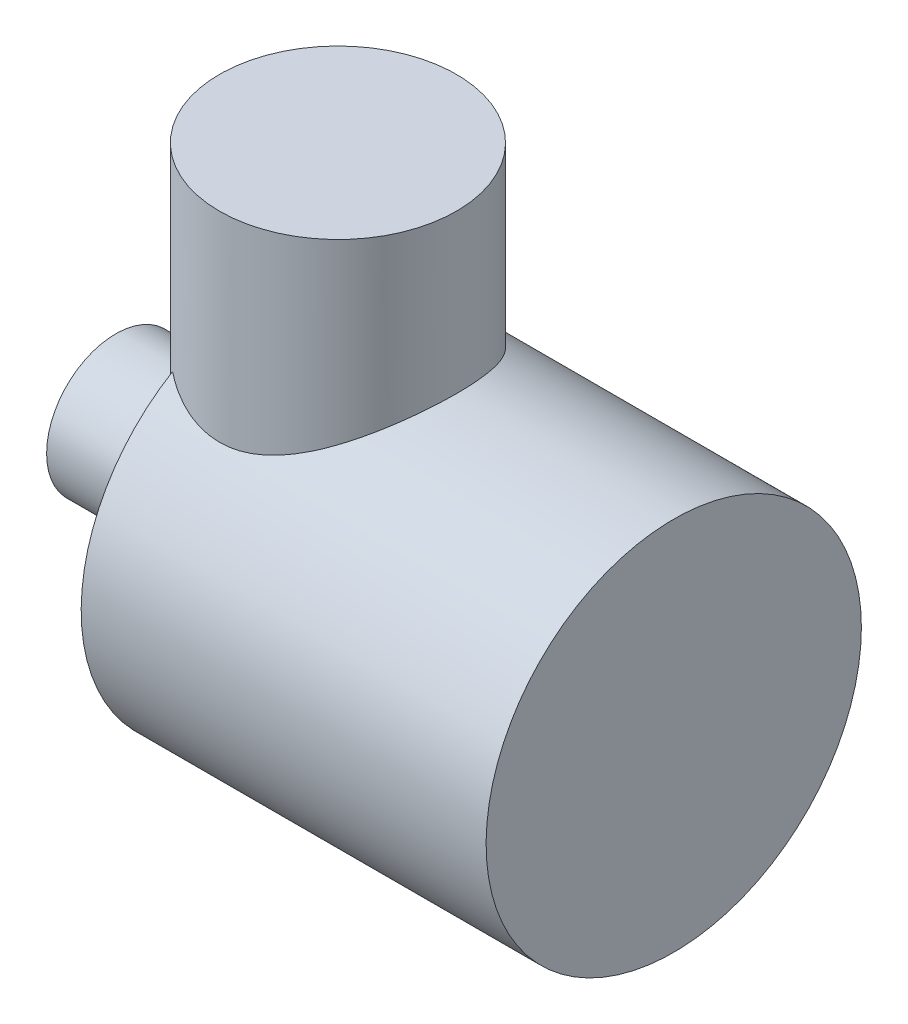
from build123d import *

# Parameters (mm, degrees)
SKETCH_1_R           = 76
EXTRUDE_1_DEPTH      = 164
SKETCH_2_R           = 28
EXTRUDE_2_DEPTH      = 62
EXTRUDE_3_DEPTH      = 140
EXTRUDE_3_DEPTH_BACK = 20
SKETCH_3_R           = 48


with BuildPart() as part:
    # Sketch 1 → Extrude 1 (new body)
    with BuildSketch(Plane(origin=(0, 0, 0), x_dir=(0, 0, -1), z_dir=(1, 0, 0))):
        Circle(SKETCH_1_R)
    extrude(amount=EXTRUDE_1_DEPTH)

    # Sketch 2 → Extrude 2 (add)
    with BuildSketch(Plane.ZY):
        with Locations(Location((0, 0, 0), (0, 0, 180))):
            Circle(SKETCH_2_R)
    extrude(amount=EXTRUDE_2_DEPTH)

    # Sketch 3 → Extrude 3 (add, two sides: drawn at the far end of the back side and taken through both)
    with BuildSketch(Plane(origin=(0, 0, 0), x_dir=(1, 0, 0), z_dir=(0, 1, 0)).offset(-EXTRUDE_3_DEPTH_BACK)):
        with Locations(Location((28, 0, 0), (0, 0, 270))):
            Circle(SKETCH_3_R)
    extrude(amount=EXTRUDE_3_DEPTH + EXTRUDE_3_DEPTH_BACK)


solid = part.part
